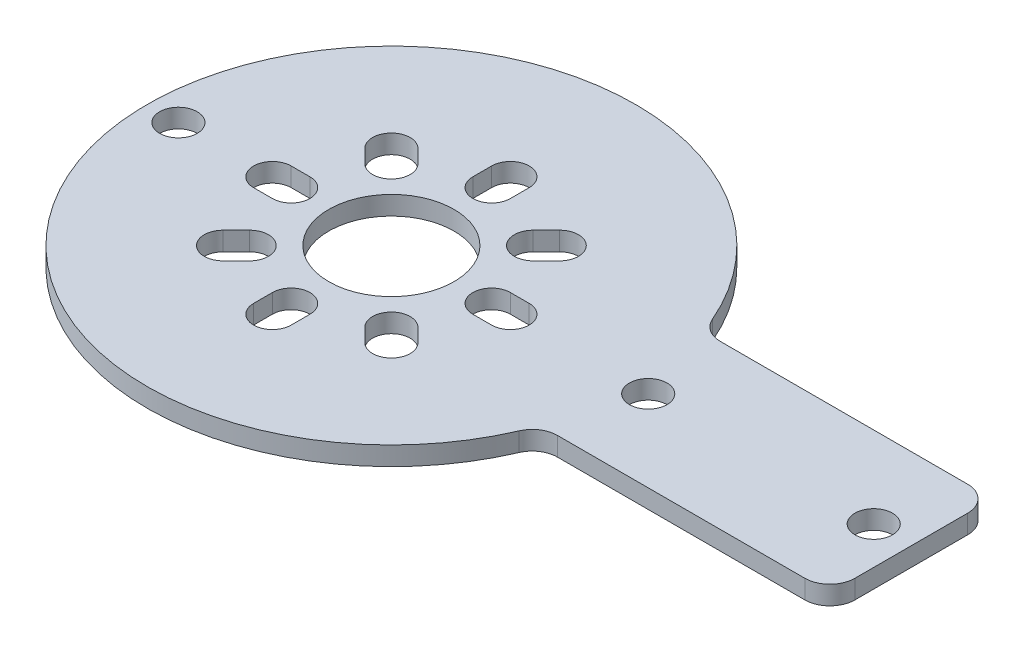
from build123d import *

# Parameters (mm, degrees)
EXTRUDE_1_DEPTH     = 1.5
SKETCH_2_R          = 5
CUT_EXTRUDE_1_DEPTH = 46.877554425
CUT_EXTRUDE_2_DEPTH = 46.877554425
SKETCH_4_R          = 1.5
CUT_EXTRUDE_3_DEPTH = 46.877554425


with BuildPart() as part:
    # Sketch 1 → Extrude 1 (new body)
    with BuildSketch(Plane(origin=(0, 0, 0), x_dir=(1, 0, 0), z_dir=(0, 1, 0))):
        with BuildLine():
            Line((19.748417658, -6.5), (39.5, -6.5))
            ThreePointArc((39.5, -6.5), (40.914213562, -5.914213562), (41.5, -4.5))
            Line((41.5, -4.5), (41.5, 4.5))
            ThreePointArc((41.5, 4.5), (40.914213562, 5.914213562), (39.5, 6.5))
            Line((39.5, 6.5), (19.748417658, 6.5))
            ThreePointArc((19.748417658, 6.5), (18.648734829, 6.829461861), (17.91135555, 7.709302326))
            ThreePointArc((17.91135555, 7.709302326), (-19.5, 0), (17.91135555, -7.709302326))
            ThreePointArc((17.91135555, -7.709302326), (18.648734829, -6.829461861), (19.748417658, -6.5))
        make_face()
    extrude(amount=EXTRUDE_1_DEPTH)

    # Sketch 2 → Cut-Extrude 1 (cut, through all)
    with BuildSketch(Plane(origin=(0, 1.5, 0), x_dir=(1, 0, 0), z_dir=(0, 1, 0))):
        with Locations(Location((0, 0, 0), (0, 0, 270))):
            Circle(SKETCH_2_R)
    extrude(amount=-CUT_EXTRUDE_1_DEPTH, mode=Mode.SUBTRACT)

    # Sketch 3 → Cut-Extrude 2 (cut, through all)
    with BuildSketch(Plane(origin=(0, 1.5, 0), x_dir=(1, 0, 0), z_dir=(0, 1, 0))):
        with BuildLine():
            Line((8, 1.5), (9.5, 1.5))
            ThreePointArc((9.5, 1.5), (11, 0), (9.5, -1.5))
            Line((9.5, -1.5), (8, -1.5))
            ThreePointArc((8, -1.5), (6.5, 0), (8, 1.5))
        make_face()
        with BuildLine():
            Line((6.717514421, -4.596194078), (7.778174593, -5.656854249))
            ThreePointArc((7.778174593, -5.656854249), (7.778174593, -7.778174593), (5.656854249, -7.778174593))
            Line((5.656854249, -7.778174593), (4.596194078, -6.717514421))
            ThreePointArc((4.596194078, -6.717514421), (4.596194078, -4.596194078), (6.717514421, -4.596194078))
        make_face()
        with BuildLine():
            Line((1.5, -8), (1.5, -9.5))
            ThreePointArc((1.5, -9.5), (0, -11), (-1.5, -9.5))
            Line((-1.5, -9.5), (-1.5, -8))
            ThreePointArc((-1.5, -8), (0, -6.5), (1.5, -8))
        make_face()
        with BuildLine():
            Line((-4.596194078, -6.717514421), (-5.656854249, -7.778174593))
            ThreePointArc((-5.656854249, -7.778174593), (-7.778174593, -7.778174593), (-7.778174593, -5.656854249))
            Line((-7.778174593, -5.656854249), (-6.717514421, -4.596194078))
            ThreePointArc((-6.717514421, -4.596194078), (-4.596194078, -4.596194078), (-4.596194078, -6.717514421))
        make_face()
        with BuildLine():
            Line((-8, -1.5), (-9.5, -1.5))
            ThreePointArc((-9.5, -1.5), (-11, 0), (-9.5, 1.5))
            Line((-9.5, 1.5), (-8, 1.5))
            ThreePointArc((-8, 1.5), (-6.5, 0), (-8, -1.5))
        make_face()
        with BuildLine():
            Line((-6.717514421, 4.596194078), (-7.778174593, 5.656854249))
            ThreePointArc((-7.778174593, 5.656854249), (-7.778174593, 7.778174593), (-5.656854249, 7.778174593))
            Line((-5.656854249, 7.778174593), (-4.596194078, 6.717514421))
            ThreePointArc((-4.596194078, 6.717514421), (-4.596194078, 4.596194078), (-6.717514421, 4.596194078))
        make_face()
        with BuildLine():
            Line((-1.5, 8), (-1.5, 9.5))
            ThreePointArc((-1.5, 9.5), (0, 11), (1.5, 9.5))
            Line((1.5, 9.5), (1.5, 8))
            ThreePointArc((1.5, 8), (0, 6.5), (-1.5, 8))
        make_face()
        with BuildLine():
            Line((4.596194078, 6.717514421), (5.656854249, 7.778174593))
            ThreePointArc((5.656854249, 7.778174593), (7.778174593, 7.778174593), (7.778174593, 5.656854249))
            Line((7.778174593, 5.656854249), (6.717514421, 4.596194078))
            ThreePointArc((6.717514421, 4.596194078), (4.596194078, 4.596194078), (4.596194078, 6.717514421))
        make_face()
    extrude(amount=-CUT_EXTRUDE_2_DEPTH, mode=Mode.SUBTRACT)

    # Sketch 4 → Cut-Extrude 3 (cut, through all)
    with BuildSketch(Plane(origin=(0, 1.5, 0), x_dir=(1, 0, 0), z_dir=(0, 1, 0))):
        with Locations(Location((-17, 0, 0), (0, 0, 270))):
            Circle(SKETCH_4_R)
        with Locations(Location((20.5, 0, 0), (0, 0, 270))):
            Circle(SKETCH_4_R)
        with Locations(Location((38.5, 0, 0), (0, 0, 270))):
            Circle(SKETCH_4_R)
    extrude(amount=-CUT_EXTRUDE_3_DEPTH, mode=Mode.SUBTRACT)


solid = part.part
